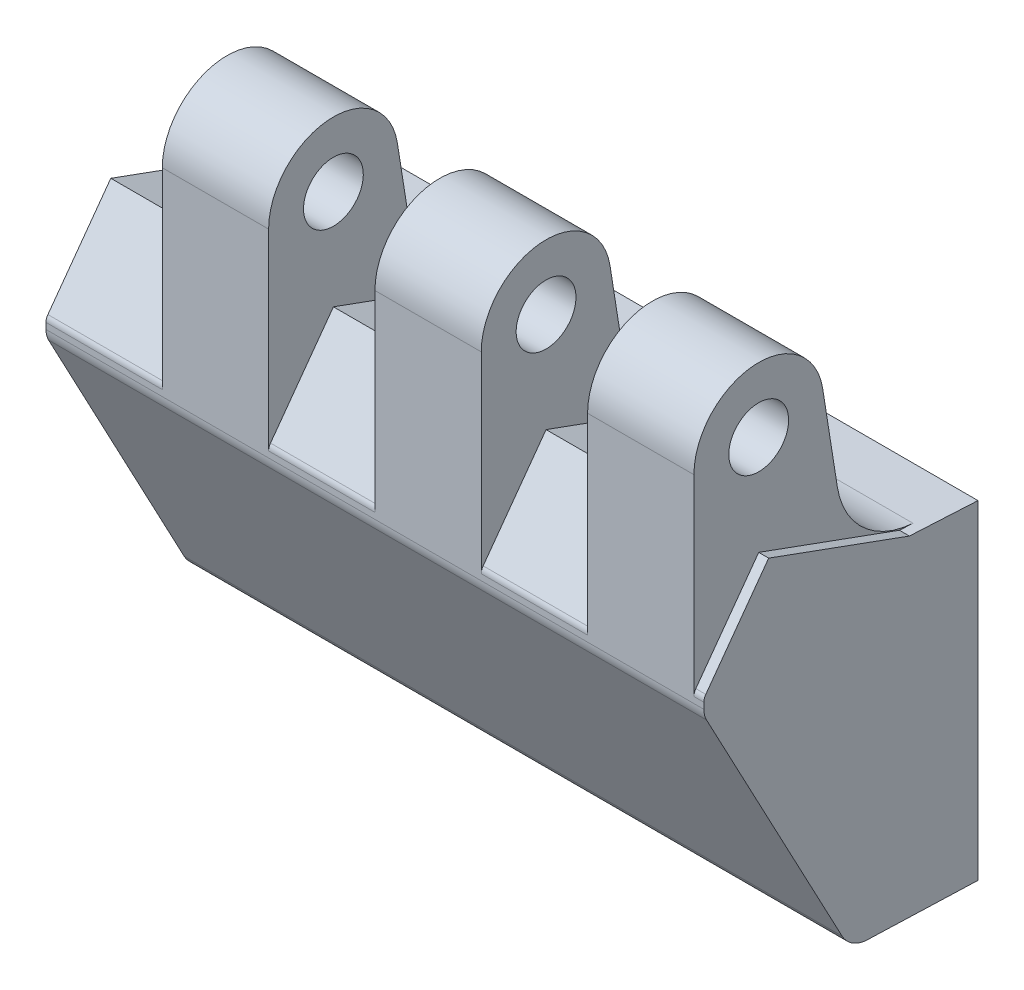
ISO-10303-21;
HEADER;
FILE_DESCRIPTION(('STEP AP214'),'2;1');
FILE_NAME('part.step','',(''),(''),'','','');
FILE_SCHEMA(('AUTOMOTIVE_DESIGN { 1 0 10303 214 1 1 1 1 }'));
ENDSEC;
DATA;
#1=APPLICATION_CONTEXT('core data for automotive mechanical design processes');
#2=APPLICATION_PROTOCOL_DEFINITION('international standard','automotive_design',2000,#1);
#3=PRODUCT_CONTEXT('',#1,'mechanical');
#4=PRODUCT('Part','Part','',(#3));
#5=PRODUCT_RELATED_PRODUCT_CATEGORY('part','',(#4));
#6=PRODUCT_DEFINITION_FORMATION('','',#4);
#7=PRODUCT_DEFINITION_CONTEXT('part definition',#1,'design');
#8=PRODUCT_DEFINITION('design','',#6,#7);
#9=PRODUCT_DEFINITION_SHAPE('','',#8);
#10=(LENGTH_UNIT() NAMED_UNIT(*) SI_UNIT(.MILLI.,.METRE.));
#11=(NAMED_UNIT(*) PLANE_ANGLE_UNIT() SI_UNIT($,.RADIAN.));
#12=(NAMED_UNIT(*) SI_UNIT($,.STERADIAN.) SOLID_ANGLE_UNIT());
#13=UNCERTAINTY_MEASURE_WITH_UNIT(LENGTH_MEASURE(1.E-05),#10,'distance_accuracy_value','');
#14=(GEOMETRIC_REPRESENTATION_CONTEXT(3) GLOBAL_UNCERTAINTY_ASSIGNED_CONTEXT((#13)) GLOBAL_UNIT_ASSIGNED_CONTEXT((#10,
#11,#12)) REPRESENTATION_CONTEXT('',''));
#15=CARTESIAN_POINT('',(0.,0.,0.));
#16=DIRECTION('',(0.,0.,1.));
#17=DIRECTION('',(1.,0.,0.));
#18=AXIS2_PLACEMENT_3D('',#15,#16,#17);
#19=CARTESIAN_POINT('',(-16.5,16.35,0.));
#20=DIRECTION('',(0.,0.998629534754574,-0.0523359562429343));
#21=DIRECTION('',(0.,0.0523359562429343,0.998629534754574));
#22=AXIS2_PLACEMENT_3D('',#19,#20,#21);
#23=PLANE('',#22);
#24=DIRECTION('',(-1.,0.,0.));
#25=VECTOR('',#24,1.);
#26=CARTESIAN_POINT('',(48.5,16.6393206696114,5.520567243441));
#27=LINE('',#26,#25);
#28=CARTESIAN_POINT('',(37.833333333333,16.6393206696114,5.52056724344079));
#29=VERTEX_POINT('',#28);
#30=CARTESIAN_POINT('',(48.5,16.6393206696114,5.520567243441));
#31=VERTEX_POINT('',#30);
#32=EDGE_CURVE('E9',#29,#31,#27,.F.);
#33=ORIENTED_EDGE('',*,*,#32,.T.);
#34=DIRECTION('',(0.,0.0523359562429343,0.998629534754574));
#35=VECTOR('',#34,1.);
#36=CARTESIAN_POINT('',(48.5,16.35,0.));
#37=LINE('',#36,#35);
#38=CARTESIAN_POINT('',(48.5,16.71068751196,6.8823277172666));
#39=VERTEX_POINT('',#38);
#40=EDGE_CURVE('E303',#31,#39,#37,.T.);
#41=ORIENTED_EDGE('',*,*,#40,.T.);
#42=DIRECTION('',(1.,0.,0.));
#43=VECTOR('',#42,1.);
#44=CARTESIAN_POINT('',(-16.5,16.71068751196,6.8823277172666));
#45=LINE('',#44,#43);
#46=CARTESIAN_POINT('',(49.5,16.71068751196,6.8823277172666));
#47=VERTEX_POINT('',#46);
#48=EDGE_CURVE('E506',#39,#47,#45,.T.);
#49=ORIENTED_EDGE('',*,*,#48,.T.);
#50=DIRECTION('',(0.,0.0523359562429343,0.998629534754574));
#51=VECTOR('',#50,1.);
#52=CARTESIAN_POINT('',(49.5,16.35,0.));
#53=LINE('',#52,#51);
#54=CARTESIAN_POINT('',(49.5,16.35,0.));
#55=VERTEX_POINT('',#54);
#56=EDGE_CURVE('E426',#55,#47,#53,.T.);
#57=ORIENTED_EDGE('',*,*,#56,.F.);
#58=DIRECTION('',(1.,0.,0.));
#59=VECTOR('',#58,1.);
#60=CARTESIAN_POINT('',(-16.5,16.35,0.));
#61=LINE('',#60,#59);
#62=CARTESIAN_POINT('',(-16.5,16.35,0.));
#63=VERTEX_POINT('',#62);
#64=EDGE_CURVE('E512',#63,#55,#61,.T.);
#65=ORIENTED_EDGE('',*,*,#64,.F.);
#66=DIRECTION('',(0.,0.0523359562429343,0.998629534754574));
#67=VECTOR('',#66,1.);
#68=CARTESIAN_POINT('',(-16.5,16.35,0.));
#69=LINE('',#68,#67);
#70=CARTESIAN_POINT('',(-16.5,16.71068751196,6.8823277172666));
#71=VERTEX_POINT('',#70);
#72=EDGE_CURVE('E456',#63,#71,#69,.T.);
#73=ORIENTED_EDGE('',*,*,#72,.T.);
#74=CARTESIAN_POINT('',(-4.833333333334,16.71068751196,6.8823277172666));
#75=VERTEX_POINT('',#74);
#76=EDGE_CURVE('E509',#71,#75,#45,.T.);
#77=ORIENTED_EDGE('',*,*,#76,.T.);
#78=DIRECTION('',(0.,0.0523359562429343,0.998629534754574));
#79=VECTOR('',#78,1.);
#80=CARTESIAN_POINT('',(-4.833333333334,16.35,0.));
#81=LINE('',#80,#79);
#82=CARTESIAN_POINT('',(-4.833333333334,16.6393206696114,5.52056724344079));
#83=VERTEX_POINT('',#82);
#84=EDGE_CURVE('E362',#83,#75,#81,.T.);
#85=ORIENTED_EDGE('',*,*,#84,.F.);
#86=DIRECTION('',(1.,0.,0.));
#87=VECTOR('',#86,1.);
#88=CARTESIAN_POINT('',(-4.833333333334,16.6393206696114,5.520567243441));
#89=LINE('',#88,#87);
#90=CARTESIAN_POINT('',(5.833333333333,16.6393206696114,5.52056724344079));
#91=VERTEX_POINT('',#90);
#92=EDGE_CURVE('E22',#91,#83,#89,.F.);
#93=ORIENTED_EDGE('',*,*,#92,.F.);
#94=DIRECTION('',(0.,0.0523359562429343,0.998629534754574));
#95=VECTOR('',#94,1.);
#96=CARTESIAN_POINT('',(5.833333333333,16.35,0.));
#97=LINE('',#96,#95);
#98=CARTESIAN_POINT('',(5.833333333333,16.71068751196,6.8823277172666));
#99=VERTEX_POINT('',#98);
#100=EDGE_CURVE('E353',#91,#99,#97,.T.);
#101=ORIENTED_EDGE('',*,*,#100,.T.);
#102=CARTESIAN_POINT('',(16.5,16.71068751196,6.8823277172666));
#103=VERTEX_POINT('',#102);
#104=EDGE_CURVE('E513',#99,#103,#45,.T.);
#105=ORIENTED_EDGE('',*,*,#104,.T.);
#106=DIRECTION('',(0.,0.0523359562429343,0.998629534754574));
#107=VECTOR('',#106,1.);
#108=CARTESIAN_POINT('',(16.5,16.35,0.));
#109=LINE('',#108,#107);
#110=CARTESIAN_POINT('',(16.5,16.6393206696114,5.52056724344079));
#111=VERTEX_POINT('',#110);
#112=EDGE_CURVE('E411',#111,#103,#109,.T.);
#113=ORIENTED_EDGE('',*,*,#112,.F.);
#114=DIRECTION('',(-1.,0.,0.));
#115=VECTOR('',#114,1.);
#116=CARTESIAN_POINT('',(27.166666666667,16.6393206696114,5.520567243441));
#117=LINE('',#116,#115);
#118=CARTESIAN_POINT('',(27.166666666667,16.6393206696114,5.520567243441));
#119=VERTEX_POINT('',#118);
#120=EDGE_CURVE('E518',#111,#119,#117,.F.);
#121=ORIENTED_EDGE('',*,*,#120,.T.);
#122=DIRECTION('',(0.,0.0523359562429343,0.998629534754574));
#123=VECTOR('',#122,1.);
#124=CARTESIAN_POINT('',(27.166666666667,16.35,0.));
#125=LINE('',#124,#123);
#126=CARTESIAN_POINT('',(27.166666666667,16.71068751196,6.8823277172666));
#127=VERTEX_POINT('',#126);
#128=EDGE_CURVE('E420',#119,#127,#125,.T.);
#129=ORIENTED_EDGE('',*,*,#128,.T.);
#130=CARTESIAN_POINT('',(37.833333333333,16.71068751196,6.8823277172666));
#131=VERTEX_POINT('',#130);
#132=EDGE_CURVE('E514',#127,#131,#45,.T.);
#133=ORIENTED_EDGE('',*,*,#132,.T.);
#134=DIRECTION('',(0.,0.0523359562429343,0.998629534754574));
#135=VECTOR('',#134,1.);
#136=CARTESIAN_POINT('',(37.833333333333,16.35,0.));
#137=LINE('',#136,#135);
#138=EDGE_CURVE('E32',#29,#131,#137,.T.);
#139=ORIENTED_EDGE('',*,*,#138,.F.);
#140=EDGE_LOOP('',(#33,#41,#49,#57,#65,#73,#77,#85,#93,#101,#105,#113,#121,#129,#133,#139));
#141=FACE_BOUND('',#140,.T.);
#142=ADVANCED_FACE('F14',(#141),#23,.T.);
#143=CARTESIAN_POINT('',(-16.5,16.71068751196,6.8823277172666));
#144=DIRECTION('',(0.,0.939692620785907,-0.342020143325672));
#145=DIRECTION('',(0.,0.342020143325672,0.939692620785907));
#146=AXIS2_PLACEMENT_3D('',#143,#144,#145);
#147=PLANE('',#146);
#148=ORIENTED_EDGE('',*,*,#48,.F.);
#149=DIRECTION('',(0.,0.342020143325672,0.939692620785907));
#150=VECTOR('',#149,1.);
#151=CARTESIAN_POINT('',(48.5,16.71068751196,6.8823277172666));
#152=LINE('',#151,#150);
#153=CARTESIAN_POINT('',(48.5,21.8491,21.));
#154=VERTEX_POINT('',#153);
#155=EDGE_CURVE('E301',#39,#154,#152,.T.);
#156=ORIENTED_EDGE('',*,*,#155,.T.);
#157=DIRECTION('',(1.,0.,0.));
#158=VECTOR('',#157,1.);
#159=CARTESIAN_POINT('',(-16.5,21.8491,21.));
#160=LINE('',#159,#158);
#161=CARTESIAN_POINT('',(49.5,21.8491,21.));
#162=VERTEX_POINT('',#161);
#163=EDGE_CURVE('E500',#154,#162,#160,.T.);
#164=ORIENTED_EDGE('',*,*,#163,.T.);
#165=DIRECTION('',(0.,0.342020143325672,0.939692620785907));
#166=VECTOR('',#165,1.);
#167=CARTESIAN_POINT('',(49.5,16.71068751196,6.8823277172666));
#168=LINE('',#167,#166);
#169=EDGE_CURVE('E429',#47,#162,#168,.T.);
#170=ORIENTED_EDGE('',*,*,#169,.F.);
#171=EDGE_LOOP('',(#148,#156,#164,#170));
#172=FACE_BOUND('',#171,.T.);
#173=ADVANCED_FACE('F574',(#172),#147,.T.);
#174=CARTESIAN_POINT('',(-16.5,21.8491,21.));
#175=DIRECTION('',(0.,0.587785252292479,0.809016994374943));
#176=DIRECTION('',(0.,-0.809016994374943,0.587785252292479));
#177=AXIS2_PLACEMENT_3D('',#174,#175,#176);
#178=PLANE('',#177);
#179=ORIENTED_EDGE('',*,*,#163,.F.);
#180=DIRECTION('',(0.,-0.809016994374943,0.587785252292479));
#181=VECTOR('',#180,1.);
#182=CARTESIAN_POINT('',(48.5,21.8491,21.));
#183=LINE('',#182,#181);
#184=CARTESIAN_POINT('',(48.5,13.165483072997,27.309016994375));
#185=VERTEX_POINT('',#184);
#186=EDGE_CURVE('E299',#154,#185,#183,.T.);
#187=ORIENTED_EDGE('',*,*,#186,.T.);
#188=DIRECTION('',(1.,0.,0.));
#189=VECTOR('',#188,1.);
#190=CARTESIAN_POINT('',(-16.5,13.165483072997,27.309016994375));
#191=LINE('',#190,#189);
#192=CARTESIAN_POINT('',(49.5,13.165483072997,27.309016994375));
#193=VERTEX_POINT('',#192);
#194=EDGE_CURVE('E494',#185,#193,#191,.T.);
#195=ORIENTED_EDGE('',*,*,#194,.T.);
#196=DIRECTION('',(0.,-0.809016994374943,0.587785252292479));
#197=VECTOR('',#196,1.);
#198=CARTESIAN_POINT('',(49.5,21.8491,21.));
#199=LINE('',#198,#197);
#200=EDGE_CURVE('E432',#162,#193,#199,.T.);
#201=ORIENTED_EDGE('',*,*,#200,.F.);
#202=EDGE_LOOP('',(#179,#187,#195,#201));
#203=FACE_BOUND('',#202,.T.);
#204=ADVANCED_FACE('F613',(#203),#178,.T.);
#205=CARTESIAN_POINT('',(-16.5,12.5776978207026,26.4999999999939));
#206=DIRECTION('',(1.,0.,0.));
#207=DIRECTION('',(0.,1.,0.));
#208=AXIS2_PLACEMENT_3D('',#205,#206,#207);
#209=CYLINDRICAL_SURFACE('',#208,1.0000000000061);
#210=ORIENTED_EDGE('',*,*,#194,.F.);
#211=CARTESIAN_POINT('',(48.5,12.5776978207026,26.4999999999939));
#212=DIRECTION('',(-1.,0.,0.));
#213=DIRECTION('',(0.,-1.,0.));
#214=AXIS2_PLACEMENT_3D('',#211,#212,#213);
#215=CIRCLE('',#214,1.0000000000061);
#216=CARTESIAN_POINT('',(48.5,12.577697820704,27.5));
#217=VERTEX_POINT('',#216);
#218=EDGE_CURVE('E297',#185,#217,#215,.F.);
#219=ORIENTED_EDGE('',*,*,#218,.T.);
#220=DIRECTION('',(1.,0.,0.));
#221=VECTOR('',#220,1.);
#222=CARTESIAN_POINT('',(-16.5,12.577697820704,27.5));
#223=LINE('',#222,#221);
#224=CARTESIAN_POINT('',(49.5,12.577697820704,27.5));
#225=VERTEX_POINT('',#224);
#226=EDGE_CURVE('E490',#217,#225,#223,.T.);
#227=ORIENTED_EDGE('',*,*,#226,.T.);
#228=CARTESIAN_POINT('',(49.5,12.5776978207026,26.4999999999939));
#229=DIRECTION('',(1.,0.,0.));
#230=DIRECTION('',(0.,1.,0.));
#231=AXIS2_PLACEMENT_3D('',#228,#229,#230);
#232=CIRCLE('',#231,1.0000000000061);
#233=EDGE_CURVE('E435',#193,#225,#232,.T.);
#234=ORIENTED_EDGE('',*,*,#233,.F.);
#235=EDGE_LOOP('',(#210,#219,#227,#234));
#236=FACE_BOUND('',#235,.T.);
#237=ADVANCED_FACE('F618',(#236),#209,.T.);
#238=ORIENTED_EDGE('',*,*,#104,.F.);
#239=DIRECTION('',(0.,0.342020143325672,0.939692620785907));
#240=VECTOR('',#239,1.);
#241=CARTESIAN_POINT('',(5.833333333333,16.71068751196,6.8823277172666));
#242=LINE('',#241,#240);
#243=CARTESIAN_POINT('',(5.833333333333,21.8491,21.));
#244=VERTEX_POINT('',#243);
#245=EDGE_CURVE('E350',#99,#244,#242,.T.);
#246=ORIENTED_EDGE('',*,*,#245,.T.);
#247=CARTESIAN_POINT('',(16.5,21.8491,21.));
#248=VERTEX_POINT('',#247);
#249=EDGE_CURVE('E507',#244,#248,#160,.T.);
#250=ORIENTED_EDGE('',*,*,#249,.T.);
#251=DIRECTION('',(0.,0.342020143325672,0.939692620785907));
#252=VECTOR('',#251,1.);
#253=CARTESIAN_POINT('',(16.5,16.71068751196,6.8823277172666));
#254=LINE('',#253,#252);
#255=EDGE_CURVE('E408',#103,#248,#254,.T.);
#256=ORIENTED_EDGE('',*,*,#255,.F.);
#257=EDGE_LOOP('',(#238,#246,#250,#256));
#258=FACE_BOUND('',#257,.T.);
#259=ADVANCED_FACE('F563',(#258),#147,.T.);
#260=ORIENTED_EDGE('',*,*,#249,.F.);
#261=DIRECTION('',(0.,-0.809016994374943,0.587785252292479));
#262=VECTOR('',#261,1.);
#263=CARTESIAN_POINT('',(5.833333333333,21.8491,21.));
#264=LINE('',#263,#262);
#265=CARTESIAN_POINT('',(5.833333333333,13.165483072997,27.309016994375));
#266=VERTEX_POINT('',#265);
#267=EDGE_CURVE('E347',#244,#266,#264,.T.);
#268=ORIENTED_EDGE('',*,*,#267,.T.);
#269=CARTESIAN_POINT('',(16.5,13.165483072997,27.309016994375));
#270=VERTEX_POINT('',#269);
#271=EDGE_CURVE('E501',#266,#270,#191,.T.);
#272=ORIENTED_EDGE('',*,*,#271,.T.);
#273=DIRECTION('',(0.,-0.809016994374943,0.587785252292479));
#274=VECTOR('',#273,1.);
#275=CARTESIAN_POINT('',(16.5,21.8491,21.));
#276=LINE('',#275,#274);
#277=EDGE_CURVE('E405',#248,#270,#276,.T.);
#278=ORIENTED_EDGE('',*,*,#277,.F.);
#279=EDGE_LOOP('',(#260,#268,#272,#278));
#280=FACE_BOUND('',#279,.T.);
#281=ADVANCED_FACE('F581',(#280),#178,.T.);
#282=ORIENTED_EDGE('',*,*,#271,.F.);
#283=CARTESIAN_POINT('',(5.833333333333,12.5776978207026,26.4999999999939));
#284=DIRECTION('',(-1.,0.,0.));
#285=DIRECTION('',(0.,-1.,0.));
#286=AXIS2_PLACEMENT_3D('',#283,#284,#285);
#287=CIRCLE('',#286,1.0000000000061);
#288=CARTESIAN_POINT('',(5.833333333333,12.577697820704,27.5));
#289=VERTEX_POINT('',#288);
#290=EDGE_CURVE('E344',#266,#289,#287,.F.);
#291=ORIENTED_EDGE('',*,*,#290,.T.);
#292=CARTESIAN_POINT('',(16.5,12.577697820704,27.5));
#293=VERTEX_POINT('',#292);
#294=EDGE_CURVE('E495',#289,#293,#223,.T.);
#295=ORIENTED_EDGE('',*,*,#294,.T.);
#296=CARTESIAN_POINT('',(16.5,12.5776978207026,26.4999999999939));
#297=DIRECTION('',(-1.,0.,0.));
#298=DIRECTION('',(0.,-1.,0.));
#299=AXIS2_PLACEMENT_3D('',#296,#297,#298);
#300=CIRCLE('',#299,1.0000000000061);
#301=EDGE_CURVE('E402',#270,#293,#300,.F.);
#302=ORIENTED_EDGE('',*,*,#301,.F.);
#303=EDGE_LOOP('',(#282,#291,#295,#302));
#304=FACE_BOUND('',#303,.T.);
#305=ADVANCED_FACE('F621',(#304),#209,.T.);
#306=DIRECTION('',(0.,0.342020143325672,0.939692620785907));
#307=VECTOR('',#306,1.);
#308=CARTESIAN_POINT('',(37.833333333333,16.71068751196,6.8823277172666));
#309=LINE('',#308,#307);
#310=CARTESIAN_POINT('',(37.833333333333,21.8491,21.));
#311=VERTEX_POINT('',#310);
#312=EDGE_CURVE('E293',#131,#311,#309,.T.);
#313=ORIENTED_EDGE('',*,*,#312,.F.);
#314=ORIENTED_EDGE('',*,*,#132,.F.);
#315=DIRECTION('',(0.,0.342020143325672,0.939692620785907));
#316=VECTOR('',#315,1.);
#317=CARTESIAN_POINT('',(27.166666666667,16.71068751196,6.8823277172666));
#318=LINE('',#317,#316);
#319=CARTESIAN_POINT('',(27.166666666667,21.8491,21.));
#320=VERTEX_POINT('',#319);
#321=EDGE_CURVE('E418',#127,#320,#318,.T.);
#322=ORIENTED_EDGE('',*,*,#321,.T.);
#323=EDGE_CURVE('E508',#320,#311,#160,.T.);
#324=ORIENTED_EDGE('',*,*,#323,.T.);
#325=EDGE_LOOP('',(#313,#314,#322,#324));
#326=FACE_BOUND('',#325,.T.);
#327=ADVANCED_FACE('F604',(#326),#147,.T.);
#328=DIRECTION('',(0.,-0.809016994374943,0.587785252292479));
#329=VECTOR('',#328,1.);
#330=CARTESIAN_POINT('',(37.833333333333,21.8491,21.));
#331=LINE('',#330,#329);
#332=CARTESIAN_POINT('',(37.833333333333,13.165483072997,27.309016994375));
#333=VERTEX_POINT('',#332);
#334=EDGE_CURVE('E290',#311,#333,#331,.T.);
#335=ORIENTED_EDGE('',*,*,#334,.F.);
#336=ORIENTED_EDGE('',*,*,#323,.F.);
#337=DIRECTION('',(0.,-0.809016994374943,0.587785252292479));
#338=VECTOR('',#337,1.);
#339=CARTESIAN_POINT('',(27.166666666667,21.8491,21.));
#340=LINE('',#339,#338);
#341=CARTESIAN_POINT('',(27.166666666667,13.165483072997,27.309016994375));
#342=VERTEX_POINT('',#341);
#343=EDGE_CURVE('E416',#320,#342,#340,.T.);
#344=ORIENTED_EDGE('',*,*,#343,.T.);
#345=EDGE_CURVE('E502',#342,#333,#191,.T.);
#346=ORIENTED_EDGE('',*,*,#345,.T.);
#347=EDGE_LOOP('',(#335,#336,#344,#346));
#348=FACE_BOUND('',#347,.T.);
#349=ADVANCED_FACE('F608',(#348),#178,.T.);
#350=CARTESIAN_POINT('',(37.833333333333,12.5776978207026,26.4999999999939));
#351=DIRECTION('',(-1.,0.,0.));
#352=DIRECTION('',(0.,-1.,0.));
#353=AXIS2_PLACEMENT_3D('',#350,#351,#352);
#354=CIRCLE('',#353,1.0000000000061);
#355=CARTESIAN_POINT('',(37.833333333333,12.577697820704,27.5));
#356=VERTEX_POINT('',#355);
#357=EDGE_CURVE('E249',#333,#356,#354,.F.);
#358=ORIENTED_EDGE('',*,*,#357,.F.);
#359=ORIENTED_EDGE('',*,*,#345,.F.);
#360=CARTESIAN_POINT('',(27.166666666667,12.5776978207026,26.4999999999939));
#361=DIRECTION('',(-1.,0.,0.));
#362=DIRECTION('',(0.,-1.,0.));
#363=AXIS2_PLACEMENT_3D('',#360,#361,#362);
#364=CIRCLE('',#363,1.0000000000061);
#365=CARTESIAN_POINT('',(27.166666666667,12.577697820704,27.5));
#366=VERTEX_POINT('',#365);
#367=EDGE_CURVE('E414',#342,#366,#364,.F.);
#368=ORIENTED_EDGE('',*,*,#367,.T.);
#369=EDGE_CURVE('E496',#366,#356,#223,.T.);
#370=ORIENTED_EDGE('',*,*,#369,.T.);
#371=EDGE_LOOP('',(#358,#359,#368,#370));
#372=FACE_BOUND('',#371,.T.);
#373=ADVANCED_FACE('F659',(#372),#209,.T.);
#374=CARTESIAN_POINT('',(-16.5,-16.262685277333,11.091242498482));
#375=DIRECTION('',(0.,-0.999390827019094,0.0348994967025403));
#376=DIRECTION('',(0.,-0.0348994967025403,-0.999390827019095));
#377=AXIS2_PLACEMENT_3D('',#374,#375,#376);
#378=PLANE('',#377);
#379=DIRECTION('',(1.,0.,0.));
#380=VECTOR('',#379,1.);
#381=CARTESIAN_POINT('',(-16.5,-16.65,0.));
#382=LINE('',#381,#380);
#383=CARTESIAN_POINT('',(-16.5,-16.65,0.));
#384=VERTEX_POINT('',#383);
#385=CARTESIAN_POINT('',(49.5,-16.65,0.));
#386=VERTEX_POINT('',#385);
#387=EDGE_CURVE('E516',#384,#386,#382,.T.);
#388=ORIENTED_EDGE('',*,*,#387,.T.);
#389=DIRECTION('',(0.,-0.0348994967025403,-0.999390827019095));
#390=VECTOR('',#389,1.);
#391=CARTESIAN_POINT('',(49.5,-16.262685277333,11.091242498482));
#392=LINE('',#391,#390);
#393=CARTESIAN_POINT('',(49.5,-16.262685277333,11.091242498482));
#394=VERTEX_POINT('',#393);
#395=EDGE_CURVE('E422',#394,#386,#392,.T.);
#396=ORIENTED_EDGE('',*,*,#395,.F.);
#397=DIRECTION('',(1.,0.,0.));
#398=VECTOR('',#397,1.);
#399=CARTESIAN_POINT('',(-16.5,-16.262685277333,11.091242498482));
#400=LINE('',#399,#398);
#401=CARTESIAN_POINT('',(-16.5,-16.262685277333,11.091242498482));
#402=VERTEX_POINT('',#401);
#403=EDGE_CURVE('E480',#402,#394,#400,.T.);
#404=ORIENTED_EDGE('',*,*,#403,.F.);
#405=DIRECTION('',(0.,-0.0348994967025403,-0.999390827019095));
#406=VECTOR('',#405,1.);
#407=CARTESIAN_POINT('',(-16.5,-16.262685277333,11.091242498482));
#408=LINE('',#407,#406);
#409=EDGE_CURVE('E450',#402,#384,#408,.T.);
#410=ORIENTED_EDGE('',*,*,#409,.T.);
#411=EDGE_LOOP('',(#388,#396,#404,#410));
#412=FACE_BOUND('',#411,.T.);
#413=ADVANCED_FACE('F16',(#412),#378,.T.);
#414=CARTESIAN_POINT('',(-16.5,-16.65,0.));
#415=DIRECTION('',(0.,0.,-1.));
#416=DIRECTION('',(-1.,0.,0.));
#417=AXIS2_PLACEMENT_3D('',#414,#415,#416);
#418=PLANE('',#417);
#419=CARTESIAN_POINT('',(0.,0.,0.));
#420=DIRECTION('',(0.,0.,-1.));
#421=DIRECTION('',(-1.,0.,0.));
#422=AXIS2_PLACEMENT_3D('',#419,#420,#421);
#423=CIRCLE('',#422,3.);
#424=CARTESIAN_POINT('',(-3.,0.,0.));
#425=VERTEX_POINT('',#424);
#426=EDGE_CURVE('E664',#425,#425,#423,.T.);
#427=ORIENTED_EDGE('',*,*,#426,.F.);
#428=EDGE_LOOP('',(#427));
#429=FACE_BOUND('',#428,.T.);
#430=CARTESIAN_POINT('',(33.,0.,0.));
#431=DIRECTION('',(0.,0.,-1.));
#432=DIRECTION('',(-1.,0.,0.));
#433=AXIS2_PLACEMENT_3D('',#430,#431,#432);
#434=CIRCLE('',#433,3.);
#435=CARTESIAN_POINT('',(30.,0.,0.));
#436=VERTEX_POINT('',#435);
#437=EDGE_CURVE('E668',#436,#436,#434,.T.);
#438=ORIENTED_EDGE('',*,*,#437,.F.);
#439=EDGE_LOOP('',(#438));
#440=FACE_BOUND('',#439,.T.);
#441=ORIENTED_EDGE('',*,*,#64,.T.);
#442=DIRECTION('',(0.,1.,0.));
#443=VECTOR('',#442,1.);
#444=CARTESIAN_POINT('',(49.5,-16.65,0.));
#445=LINE('',#444,#443);
#446=EDGE_CURVE('E423',#386,#55,#445,.T.);
#447=ORIENTED_EDGE('',*,*,#446,.F.);
#448=ORIENTED_EDGE('',*,*,#387,.F.);
#449=DIRECTION('',(0.,1.,0.));
#450=VECTOR('',#449,1.);
#451=CARTESIAN_POINT('',(-16.5,-16.65,0.));
#452=LINE('',#451,#450);
#453=EDGE_CURVE('E453',#384,#63,#452,.T.);
#454=ORIENTED_EDGE('',*,*,#453,.T.);
#455=EDGE_LOOP('',(#441,#447,#448,#454));
#456=FACE_BOUND('',#455,.T.);
#457=ADVANCED_FACE('F651',(#429,#440,#456),#418,.T.);
#458=DIRECTION('',(0.,0.342020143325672,0.939692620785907));
#459=VECTOR('',#458,1.);
#460=CARTESIAN_POINT('',(-4.833333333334,16.71068751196,6.8823277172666));
#461=LINE('',#460,#459);
#462=CARTESIAN_POINT('',(-4.833333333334,21.8491,21.));
#463=VERTEX_POINT('',#462);
#464=EDGE_CURVE('E360',#75,#463,#461,.T.);
#465=ORIENTED_EDGE('',*,*,#464,.F.);
#466=ORIENTED_EDGE('',*,*,#76,.F.);
#467=DIRECTION('',(0.,0.342020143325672,0.939692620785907));
#468=VECTOR('',#467,1.);
#469=CARTESIAN_POINT('',(-16.5,16.71068751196,6.8823277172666));
#470=LINE('',#469,#468);
#471=CARTESIAN_POINT('',(-16.5,21.8491,21.));
#472=VERTEX_POINT('',#471);
#473=EDGE_CURVE('E459',#71,#472,#470,.T.);
#474=ORIENTED_EDGE('',*,*,#473,.T.);
#475=EDGE_CURVE('E503',#472,#463,#160,.T.);
#476=ORIENTED_EDGE('',*,*,#475,.T.);
#477=EDGE_LOOP('',(#465,#466,#474,#476));
#478=FACE_BOUND('',#477,.T.);
#479=ADVANCED_FACE('F535',(#478),#147,.T.);
#480=DIRECTION('',(0.,-0.809016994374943,0.587785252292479));
#481=VECTOR('',#480,1.);
#482=CARTESIAN_POINT('',(-4.833333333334,21.8491,21.));
#483=LINE('',#482,#481);
#484=CARTESIAN_POINT('',(-4.833333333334,13.165483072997,27.309016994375));
#485=VERTEX_POINT('',#484);
#486=EDGE_CURVE('E358',#463,#485,#483,.T.);
#487=ORIENTED_EDGE('',*,*,#486,.F.);
#488=ORIENTED_EDGE('',*,*,#475,.F.);
#489=DIRECTION('',(0.,-0.809016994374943,0.587785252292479));
#490=VECTOR('',#489,1.);
#491=CARTESIAN_POINT('',(-16.5,21.8491,21.));
#492=LINE('',#491,#490);
#493=CARTESIAN_POINT('',(-16.5,13.165483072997,27.309016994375));
#494=VERTEX_POINT('',#493);
#495=EDGE_CURVE('E462',#472,#494,#492,.T.);
#496=ORIENTED_EDGE('',*,*,#495,.T.);
#497=EDGE_CURVE('E497',#494,#485,#191,.T.);
#498=ORIENTED_EDGE('',*,*,#497,.T.);
#499=EDGE_LOOP('',(#487,#488,#496,#498));
#500=FACE_BOUND('',#499,.T.);
#501=ADVANCED_FACE('F540',(#500),#178,.T.);
#502=CARTESIAN_POINT('',(-4.833333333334,12.5776978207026,26.4999999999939));
#503=DIRECTION('',(-1.,0.,0.));
#504=DIRECTION('',(0.,-1.,0.));
#505=AXIS2_PLACEMENT_3D('',#502,#503,#504);
#506=CIRCLE('',#505,1.0000000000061);
#507=CARTESIAN_POINT('',(-4.833333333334,12.577697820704,27.5));
#508=VERTEX_POINT('',#507);
#509=EDGE_CURVE('E356',#485,#508,#506,.F.);
#510=ORIENTED_EDGE('',*,*,#509,.F.);
#511=ORIENTED_EDGE('',*,*,#497,.F.);
#512=CARTESIAN_POINT('',(-16.5,12.5776978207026,26.4999999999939));
#513=DIRECTION('',(1.,0.,0.));
#514=DIRECTION('',(0.,1.,0.));
#515=AXIS2_PLACEMENT_3D('',#512,#513,#514);
#516=CIRCLE('',#515,1.0000000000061);
#517=CARTESIAN_POINT('',(-16.5,12.577697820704,27.5));
#518=VERTEX_POINT('',#517);
#519=EDGE_CURVE('E465',#494,#518,#516,.T.);
#520=ORIENTED_EDGE('',*,*,#519,.T.);
#521=EDGE_CURVE('E491',#518,#508,#223,.T.);
#522=ORIENTED_EDGE('',*,*,#521,.T.);
#523=EDGE_LOOP('',(#510,#511,#520,#522));
#524=FACE_BOUND('',#523,.T.);
#525=ADVANCED_FACE('F543',(#524),#209,.T.);
#526=CARTESIAN_POINT('',(-16.5,12.577697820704,27.5));
#527=DIRECTION('',(0.,0.,1.));
#528=DIRECTION('',(1.,0.,0.));
#529=AXIS2_PLACEMENT_3D('',#526,#527,#528);
#530=PLANE('',#529);
#531=ORIENTED_EDGE('',*,*,#226,.F.);
#532=DIRECTION('',(0.,-1.,0.));
#533=VECTOR('',#532,1.);
#534=CARTESIAN_POINT('',(48.5,31.85,27.5));
#535=LINE('',#534,#533);
#536=CARTESIAN_POINT('',(48.5,31.85,27.5));
#537=VERTEX_POINT('',#536);
#538=EDGE_CURVE('E273',#537,#217,#535,.T.);
#539=ORIENTED_EDGE('',*,*,#538,.F.);
#540=DIRECTION('',(-1.,0.,0.));
#541=VECTOR('',#540,1.);
#542=CARTESIAN_POINT('',(48.5,31.85,27.5));
#543=LINE('',#542,#541);
#544=CARTESIAN_POINT('',(37.833333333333,31.85,27.5));
#545=VERTEX_POINT('',#544);
#546=EDGE_CURVE('E284',#537,#545,#543,.T.);
#547=ORIENTED_EDGE('',*,*,#546,.T.);
#548=DIRECTION('',(0.,-1.,0.));
#549=VECTOR('',#548,1.);
#550=CARTESIAN_POINT('',(37.833333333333,31.85,27.5));
#551=LINE('',#550,#549);
#552=EDGE_CURVE('E242',#545,#356,#551,.T.);
#553=ORIENTED_EDGE('',*,*,#552,.T.);
#554=ORIENTED_EDGE('',*,*,#369,.F.);
#555=DIRECTION('',(0.,-1.,0.));
#556=VECTOR('',#555,1.);
#557=CARTESIAN_POINT('',(27.166666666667,31.85,27.5));
#558=LINE('',#557,#556);
#559=CARTESIAN_POINT('',(27.166666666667,31.85,27.5));
#560=VERTEX_POINT('',#559);
#561=EDGE_CURVE('E381',#560,#366,#558,.T.);
#562=ORIENTED_EDGE('',*,*,#561,.F.);
#563=DIRECTION('',(-1.,0.,0.));
#564=VECTOR('',#563,1.);
#565=CARTESIAN_POINT('',(27.166666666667,31.85,27.5));
#566=LINE('',#565,#564);
#567=CARTESIAN_POINT('',(16.5,31.85,27.5));
#568=VERTEX_POINT('',#567);
#569=EDGE_CURVE('E393',#560,#568,#566,.T.);
#570=ORIENTED_EDGE('',*,*,#569,.T.);
#571=DIRECTION('',(0.,-1.,0.));
#572=VECTOR('',#571,1.);
#573=CARTESIAN_POINT('',(16.5,31.85,27.5));
#574=LINE('',#573,#572);
#575=EDGE_CURVE('E364',#568,#293,#574,.T.);
#576=ORIENTED_EDGE('',*,*,#575,.T.);
#577=ORIENTED_EDGE('',*,*,#294,.F.);
#578=DIRECTION('',(0.,-1.,0.));
#579=VECTOR('',#578,1.);
#580=CARTESIAN_POINT('',(5.833333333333,31.85,27.5));
#581=LINE('',#580,#579);
#582=CARTESIAN_POINT('',(5.833333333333,31.85,27.5));
#583=VERTEX_POINT('',#582);
#584=EDGE_CURVE('E305',#583,#289,#581,.T.);
#585=ORIENTED_EDGE('',*,*,#584,.F.);
#586=DIRECTION('',(1.,0.,0.));
#587=VECTOR('',#586,1.);
#588=CARTESIAN_POINT('',(-4.833333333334,31.85,27.5));
#589=LINE('',#588,#587);
#590=CARTESIAN_POINT('',(-4.833333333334,31.85,27.5));
#591=VERTEX_POINT('',#590);
#592=EDGE_CURVE('E337',#591,#583,#589,.T.);
#593=ORIENTED_EDGE('',*,*,#592,.F.);
#594=DIRECTION('',(0.,-1.,0.));
#595=VECTOR('',#594,1.);
#596=CARTESIAN_POINT('',(-4.833333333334,31.85,27.5));
#597=LINE('',#596,#595);
#598=EDGE_CURVE('E323',#591,#508,#597,.T.);
#599=ORIENTED_EDGE('',*,*,#598,.T.);
#600=ORIENTED_EDGE('',*,*,#521,.F.);
#601=DIRECTION('',(0.,-1.,0.));
#602=VECTOR('',#601,1.);
#603=CARTESIAN_POINT('',(-16.5,12.577697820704,27.5));
#604=LINE('',#603,#602);
#605=CARTESIAN_POINT('',(-16.5,11.963605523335,27.5));
#606=VERTEX_POINT('',#605);
#607=EDGE_CURVE('E468',#518,#606,#604,.T.);
#608=ORIENTED_EDGE('',*,*,#607,.T.);
#609=DIRECTION('',(1.,0.,0.));
#610=VECTOR('',#609,1.);
#611=CARTESIAN_POINT('',(-16.5,11.963605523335,27.5));
#612=LINE('',#611,#610);
#613=CARTESIAN_POINT('',(49.5,11.963605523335,27.5));
#614=VERTEX_POINT('',#613);
#615=EDGE_CURVE('E488',#606,#614,#612,.T.);
#616=ORIENTED_EDGE('',*,*,#615,.T.);
#617=DIRECTION('',(0.,-1.,0.));
#618=VECTOR('',#617,1.);
#619=CARTESIAN_POINT('',(49.5,12.577697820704,27.5));
#620=LINE('',#619,#618);
#621=EDGE_CURVE('E438',#225,#614,#620,.T.);
#622=ORIENTED_EDGE('',*,*,#621,.F.);
#623=EDGE_LOOP('',(#531,#539,#547,#553,#554,#562,#570,#576,#577,#585,#593,#599,#600,#608,#616,#622));
#624=FACE_BOUND('',#623,.T.);
#625=ADVANCED_FACE('F548',(#624),#530,.T.);
#626=CARTESIAN_POINT('',(-16.5,11.963605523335,25.2499999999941));
#627=DIRECTION('',(1.,0.,0.));
#628=DIRECTION('',(0.,1.,0.));
#629=AXIS2_PLACEMENT_3D('',#626,#627,#628);
#630=CYLINDRICAL_SURFACE('',#629,2.25000000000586);
#631=DIRECTION('',(1.,0.,0.));
#632=VECTOR('',#631,1.);
#633=CARTESIAN_POINT('',(-16.5,10.907294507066,27.236632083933));
#634=LINE('',#633,#632);
#635=CARTESIAN_POINT('',(-16.5,10.907294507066,27.236632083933));
#636=VERTEX_POINT('',#635);
#637=CARTESIAN_POINT('',(49.5,10.907294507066,27.236632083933));
#638=VERTEX_POINT('',#637);
#639=EDGE_CURVE('E486',#636,#638,#634,.T.);
#640=ORIENTED_EDGE('',*,*,#639,.T.);
#641=CARTESIAN_POINT('',(49.5,11.963605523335,25.2499999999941));
#642=DIRECTION('',(1.,0.,0.));
#643=DIRECTION('',(0.,1.,0.));
#644=AXIS2_PLACEMENT_3D('',#641,#642,#643);
#645=CIRCLE('',#644,2.25000000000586);
#646=EDGE_CURVE('E441',#614,#638,#645,.T.);
#647=ORIENTED_EDGE('',*,*,#646,.F.);
#648=ORIENTED_EDGE('',*,*,#615,.F.);
#649=CARTESIAN_POINT('',(-16.5,11.963605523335,25.2499999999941));
#650=DIRECTION('',(1.,0.,0.));
#651=DIRECTION('',(0.,1.,0.));
#652=AXIS2_PLACEMENT_3D('',#649,#650,#651);
#653=CIRCLE('',#652,2.25000000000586);
#654=EDGE_CURVE('E471',#606,#636,#653,.T.);
#655=ORIENTED_EDGE('',*,*,#654,.T.);
#656=EDGE_LOOP('',(#640,#647,#648,#655));
#657=FACE_BOUND('',#656,.T.);
#658=ADVANCED_FACE('F678',(#657),#630,.T.);
#659=CARTESIAN_POINT('',(-16.5,10.907294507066,27.236632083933));
#660=DIRECTION('',(0.,-0.469471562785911,0.882947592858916));
#661=DIRECTION('',(0.,-0.882947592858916,-0.469471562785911));
#662=AXIS2_PLACEMENT_3D('',#659,#660,#661);
#663=PLANE('',#662);
#664=DIRECTION('',(1.,0.,0.));
#665=VECTOR('',#664,1.);
#666=CARTESIAN_POINT('',(-16.5,-14.672927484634,13.635386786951));
#667=LINE('',#666,#665);
#668=CARTESIAN_POINT('',(-16.5,-14.672927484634,13.635386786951));
#669=VERTEX_POINT('',#668);
#670=CARTESIAN_POINT('',(49.5,-14.672927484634,13.635386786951));
#671=VERTEX_POINT('',#670);
#672=EDGE_CURVE('E484',#669,#671,#667,.T.);
#673=ORIENTED_EDGE('',*,*,#672,.T.);
#674=DIRECTION('',(0.,-0.882947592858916,-0.469471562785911));
#675=VECTOR('',#674,1.);
#676=CARTESIAN_POINT('',(49.5,10.907294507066,27.236632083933));
#677=LINE('',#676,#675);
#678=EDGE_CURVE('E444',#638,#671,#677,.T.);
#679=ORIENTED_EDGE('',*,*,#678,.F.);
#680=ORIENTED_EDGE('',*,*,#639,.F.);
#681=DIRECTION('',(0.,-0.882947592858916,-0.469471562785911));
#682=VECTOR('',#681,1.);
#683=CARTESIAN_POINT('',(-16.5,10.907294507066,27.236632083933));
#684=LINE('',#683,#682);
#685=EDGE_CURVE('E474',#636,#669,#684,.T.);
#686=ORIENTED_EDGE('',*,*,#685,.T.);
#687=EDGE_LOOP('',(#673,#679,#680,#686));
#688=FACE_BOUND('',#687,.T.);
#689=ADVANCED_FACE('F680',(#688),#663,.T.);
#690=CARTESIAN_POINT('',(-16.5,-13.2645127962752,10.9865440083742));
#691=DIRECTION('',(1.,0.,0.));
#692=DIRECTION('',(0.,1.,0.));
#693=AXIS2_PLACEMENT_3D('',#690,#691,#692);
#694=CYLINDRICAL_SURFACE('',#693,3.00000000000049);
#695=ORIENTED_EDGE('',*,*,#403,.T.);
#696=CARTESIAN_POINT('',(49.5,-13.2645127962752,10.9865440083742));
#697=DIRECTION('',(1.,0.,0.));
#698=DIRECTION('',(0.,1.,0.));
#699=AXIS2_PLACEMENT_3D('',#696,#697,#698);
#700=CIRCLE('',#699,3.00000000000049);
#701=EDGE_CURVE('E447',#671,#394,#700,.T.);
#702=ORIENTED_EDGE('',*,*,#701,.F.);
#703=ORIENTED_EDGE('',*,*,#672,.F.);
#704=CARTESIAN_POINT('',(-16.5,-13.2645127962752,10.9865440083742));
#705=DIRECTION('',(1.,0.,0.));
#706=DIRECTION('',(0.,1.,0.));
#707=AXIS2_PLACEMENT_3D('',#704,#705,#706);
#708=CIRCLE('',#707,3.00000000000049);
#709=EDGE_CURVE('E477',#669,#402,#708,.T.);
#710=ORIENTED_EDGE('',*,*,#709,.T.);
#711=EDGE_LOOP('',(#695,#702,#703,#710));
#712=FACE_BOUND('',#711,.T.);
#713=ADVANCED_FACE('F685',(#712),#694,.T.);
#714=CARTESIAN_POINT('',(-16.5,12.5776978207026,26.4999999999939));
#715=DIRECTION('',(1.,0.,0.));
#716=DIRECTION('',(0.,1.,0.));
#717=AXIS2_PLACEMENT_3D('',#714,#715,#716);
#718=PLANE('',#717);
#719=ORIENTED_EDGE('',*,*,#409,.F.);
#720=ORIENTED_EDGE('',*,*,#709,.F.);
#721=ORIENTED_EDGE('',*,*,#685,.F.);
#722=ORIENTED_EDGE('',*,*,#654,.F.);
#723=ORIENTED_EDGE('',*,*,#607,.F.);
#724=ORIENTED_EDGE('',*,*,#519,.F.);
#725=ORIENTED_EDGE('',*,*,#495,.F.);
#726=ORIENTED_EDGE('',*,*,#473,.F.);
#727=ORIENTED_EDGE('',*,*,#72,.F.);
#728=ORIENTED_EDGE('',*,*,#453,.F.);
#729=EDGE_LOOP('',(#719,#720,#721,#722,#723,#724,#725,#726,#727,#728));
#730=FACE_BOUND('',#729,.T.);
#731=ADVANCED_FACE('F672',(#730),#718,.F.);
#732=CARTESIAN_POINT('',(49.5,12.5776978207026,26.4999999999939));
#733=DIRECTION('',(1.,0.,0.));
#734=DIRECTION('',(0.,1.,0.));
#735=AXIS2_PLACEMENT_3D('',#732,#733,#734);
#736=PLANE('',#735);
#737=ORIENTED_EDGE('',*,*,#395,.T.);
#738=ORIENTED_EDGE('',*,*,#446,.T.);
#739=ORIENTED_EDGE('',*,*,#56,.T.);
#740=ORIENTED_EDGE('',*,*,#169,.T.);
#741=ORIENTED_EDGE('',*,*,#200,.T.);
#742=ORIENTED_EDGE('',*,*,#233,.T.);
#743=ORIENTED_EDGE('',*,*,#621,.T.);
#744=ORIENTED_EDGE('',*,*,#646,.T.);
#745=ORIENTED_EDGE('',*,*,#678,.T.);
#746=ORIENTED_EDGE('',*,*,#701,.T.);
#747=EDGE_LOOP('',(#737,#738,#739,#740,#741,#742,#743,#744,#745,#746));
#748=FACE_BOUND('',#747,.T.);
#749=ADVANCED_FACE('F571',(#748),#736,.T.);
#750=CARTESIAN_POINT('',(27.166666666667,24.870299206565,4.96066339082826));
#751=DIRECTION('',(-1.,0.,0.));
#752=DIRECTION('',(0.,-1.,0.));
#753=AXIS2_PLACEMENT_3D('',#750,#751,#752);
#754=CYLINDRICAL_SURFACE('',#753,8.2499999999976);
#755=ORIENTED_EDGE('',*,*,#120,.F.);
#756=CARTESIAN_POINT('',(16.5,24.870299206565,4.96066339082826));
#757=DIRECTION('',(-1.,0.,0.));
#758=DIRECTION('',(0.,1.,0.));
#759=AXIS2_PLACEMENT_3D('',#756,#757,#758);
#760=CIRCLE('',#759,8.2499999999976);
#761=CARTESIAN_POINT('',(16.5,23.5797148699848,13.109092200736));
#762=VERTEX_POINT('',#761);
#763=EDGE_CURVE('E365',#111,#762,#760,.T.);
#764=ORIENTED_EDGE('',*,*,#763,.T.);
#765=DIRECTION('',(-1.,0.,0.));
#766=VECTOR('',#765,1.);
#767=CARTESIAN_POINT('',(27.166666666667,23.5797148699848,13.109092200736));
#768=LINE('',#767,#766);
#769=CARTESIAN_POINT('',(27.166666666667,23.5797148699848,13.109092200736));
#770=VERTEX_POINT('',#769);
#771=EDGE_CURVE('E399',#770,#762,#768,.T.);
#772=ORIENTED_EDGE('',*,*,#771,.F.);
#773=CARTESIAN_POINT('',(27.166666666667,24.870299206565,4.96066339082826));
#774=DIRECTION('',(-1.,0.,0.));
#775=DIRECTION('',(0.,1.,0.));
#776=AXIS2_PLACEMENT_3D('',#773,#774,#775);
#777=CIRCLE('',#776,8.2499999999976);
#778=EDGE_CURVE('E382',#119,#770,#777,.T.);
#779=ORIENTED_EDGE('',*,*,#778,.F.);
#780=EDGE_LOOP('',(#755,#764,#772,#779));
#781=FACE_BOUND('',#780,.T.);
#782=ADVANCED_FACE('F593',(#781),#754,.F.);
#783=CARTESIAN_POINT('',(27.166666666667,23.5797148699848,13.109092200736));
#784=DIRECTION('',(0.,-0.156434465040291,0.987688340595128));
#785=DIRECTION('',(0.,-0.987688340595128,-0.156434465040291));
#786=AXIS2_PLACEMENT_3D('',#783,#784,#785);
#787=PLANE('',#786);
#788=DIRECTION('',(0.,0.987688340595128,0.156434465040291));
#789=VECTOR('',#788,1.);
#790=CARTESIAN_POINT('',(16.5,23.5797148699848,13.109092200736));
#791=LINE('',#790,#789);
#792=CARTESIAN_POINT('',(16.5,32.8668240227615,14.580025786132));
#793=VERTEX_POINT('',#792);
#794=EDGE_CURVE('E368',#762,#793,#791,.T.);
#795=ORIENTED_EDGE('',*,*,#794,.T.);
#796=DIRECTION('',(-1.,0.,0.));
#797=VECTOR('',#796,1.);
#798=CARTESIAN_POINT('',(27.166666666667,32.8668240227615,14.580025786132));
#799=LINE('',#798,#797);
#800=CARTESIAN_POINT('',(27.166666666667,32.8668240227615,14.580025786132));
#801=VERTEX_POINT('',#800);
#802=EDGE_CURVE('E396',#801,#793,#799,.T.);
#803=ORIENTED_EDGE('',*,*,#802,.F.);
#804=DIRECTION('',(0.,0.987688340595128,0.156434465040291));
#805=VECTOR('',#804,1.);
#806=CARTESIAN_POINT('',(27.166666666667,23.5797148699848,13.109092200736));
#807=LINE('',#806,#805);
#808=EDGE_CURVE('E384',#770,#801,#807,.T.);
#809=ORIENTED_EDGE('',*,*,#808,.F.);
#810=ORIENTED_EDGE('',*,*,#771,.T.);
#811=EDGE_LOOP('',(#795,#803,#809,#810));
#812=FACE_BOUND('',#811,.T.);
#813=ADVANCED_FACE('F631',(#812),#787,.F.);
#814=CARTESIAN_POINT('',(27.166666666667,31.85,21.));
#815=DIRECTION('',(-1.,0.,0.));
#816=DIRECTION('',(0.,-1.,0.));
#817=AXIS2_PLACEMENT_3D('',#814,#815,#816);
#818=CYLINDRICAL_SURFACE('',#817,6.49999999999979);
#819=CARTESIAN_POINT('',(16.5,31.85,21.));
#820=DIRECTION('',(1.,0.,0.));
#821=DIRECTION('',(0.,-1.,0.));
#822=AXIS2_PLACEMENT_3D('',#819,#820,#821);
#823=CIRCLE('',#822,6.49999999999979);
#824=EDGE_CURVE('E371',#793,#568,#823,.T.);
#825=ORIENTED_EDGE('',*,*,#824,.T.);
#826=ORIENTED_EDGE('',*,*,#569,.F.);
#827=CARTESIAN_POINT('',(27.166666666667,31.85,21.));
#828=DIRECTION('',(1.,0.,0.));
#829=DIRECTION('',(0.,-1.,0.));
#830=AXIS2_PLACEMENT_3D('',#827,#828,#829);
#831=CIRCLE('',#830,6.49999999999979);
#832=EDGE_CURVE('E386',#801,#560,#831,.T.);
#833=ORIENTED_EDGE('',*,*,#832,.F.);
#834=ORIENTED_EDGE('',*,*,#802,.T.);
#835=EDGE_LOOP('',(#825,#826,#833,#834));
#836=FACE_BOUND('',#835,.T.);
#837=ADVANCED_FACE('F629',(#836),#818,.T.);
#838=CARTESIAN_POINT('',(27.166666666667,31.85,21.));
#839=DIRECTION('',(-1.,0.,0.));
#840=DIRECTION('',(0.,-1.,0.));
#841=AXIS2_PLACEMENT_3D('',#838,#839,#840);
#842=CYLINDRICAL_SURFACE('',#841,3.);
#843=CARTESIAN_POINT('',(27.166666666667,31.85,21.));
#844=DIRECTION('',(1.,0.,0.));
#845=DIRECTION('',(0.,1.,0.));
#846=AXIS2_PLACEMENT_3D('',#843,#844,#845);
#847=CIRCLE('',#846,3.);
#848=CARTESIAN_POINT('',(27.166666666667,34.85,21.));
#849=VERTEX_POINT('',#848);
#850=EDGE_CURVE('E388',#849,#849,#847,.T.);
#851=ORIENTED_EDGE('',*,*,#850,.T.);
#852=EDGE_LOOP('',(#851));
#853=FACE_BOUND('',#852,.T.);
#854=CARTESIAN_POINT('',(16.5,31.85,21.));
#855=DIRECTION('',(1.,0.,0.));
#856=DIRECTION('',(0.,1.,0.));
#857=AXIS2_PLACEMENT_3D('',#854,#855,#856);
#858=CIRCLE('',#857,3.);
#859=CARTESIAN_POINT('',(16.5,34.85,21.));
#860=VERTEX_POINT('',#859);
#861=EDGE_CURVE('E374',#860,#860,#858,.T.);
#862=ORIENTED_EDGE('',*,*,#861,.F.);
#863=EDGE_LOOP('',(#862));
#864=FACE_BOUND('',#863,.T.);
#865=ADVANCED_FACE('F640',(#853,#864),#842,.F.);
#866=CARTESIAN_POINT('',(27.166666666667,24.870299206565,4.96066339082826));
#867=DIRECTION('',(-1.,0.,0.));
#868=DIRECTION('',(0.,-1.,0.));
#869=AXIS2_PLACEMENT_3D('',#866,#867,#868);
#870=PLANE('',#869);
#871=ORIENTED_EDGE('',*,*,#128,.F.);
#872=ORIENTED_EDGE('',*,*,#778,.T.);
#873=ORIENTED_EDGE('',*,*,#808,.T.);
#874=ORIENTED_EDGE('',*,*,#832,.T.);
#875=ORIENTED_EDGE('',*,*,#561,.T.);
#876=ORIENTED_EDGE('',*,*,#367,.F.);
#877=ORIENTED_EDGE('',*,*,#343,.F.);
#878=ORIENTED_EDGE('',*,*,#321,.F.);
#879=EDGE_LOOP('',(#871,#872,#873,#874,#875,#876,#877,#878));
#880=FACE_BOUND('',#879,.T.);
#881=ORIENTED_EDGE('',*,*,#850,.F.);
#882=EDGE_LOOP('',(#881));
#883=FACE_BOUND('',#882,.T.);
#884=ADVANCED_FACE('F597',(#880,#883),#870,.F.);
#885=CARTESIAN_POINT('',(16.5,24.870299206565,4.96066339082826));
#886=DIRECTION('',(-1.,0.,0.));
#887=DIRECTION('',(0.,-1.,0.));
#888=AXIS2_PLACEMENT_3D('',#885,#886,#887);
#889=PLANE('',#888);
#890=ORIENTED_EDGE('',*,*,#763,.F.);
#891=ORIENTED_EDGE('',*,*,#112,.T.);
#892=ORIENTED_EDGE('',*,*,#255,.T.);
#893=ORIENTED_EDGE('',*,*,#277,.T.);
#894=ORIENTED_EDGE('',*,*,#301,.T.);
#895=ORIENTED_EDGE('',*,*,#575,.F.);
#896=ORIENTED_EDGE('',*,*,#824,.F.);
#897=ORIENTED_EDGE('',*,*,#794,.F.);
#898=EDGE_LOOP('',(#890,#891,#892,#893,#894,#895,#896,#897));
#899=FACE_BOUND('',#898,.T.);
#900=ORIENTED_EDGE('',*,*,#861,.T.);
#901=EDGE_LOOP('',(#900));
#902=FACE_BOUND('',#901,.T.);
#903=ADVANCED_FACE('F586',(#899,#902),#889,.T.);
#904=CARTESIAN_POINT('',(-4.833333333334,24.870299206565,4.96066339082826));
#905=DIRECTION('',(1.,0.,0.));
#906=DIRECTION('',(0.,1.,0.));
#907=AXIS2_PLACEMENT_3D('',#904,#905,#906);
#908=CYLINDRICAL_SURFACE('',#907,8.2499999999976);
#909=CARTESIAN_POINT('',(5.833333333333,24.870299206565,4.96066339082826));
#910=DIRECTION('',(-1.,0.,0.));
#911=DIRECTION('',(0.,1.,0.));
#912=AXIS2_PLACEMENT_3D('',#909,#910,#911);
#913=CIRCLE('',#912,8.2499999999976);
#914=CARTESIAN_POINT('',(5.833333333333,23.5797148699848,13.109092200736));
#915=VERTEX_POINT('',#914);
#916=EDGE_CURVE('E306',#91,#915,#913,.T.);
#917=ORIENTED_EDGE('',*,*,#916,.F.);
#918=ORIENTED_EDGE('',*,*,#92,.T.);
#919=CARTESIAN_POINT('',(-4.833333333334,24.870299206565,4.96066339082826));
#920=DIRECTION('',(-1.,0.,0.));
#921=DIRECTION('',(0.,1.,0.));
#922=AXIS2_PLACEMENT_3D('',#919,#920,#921);
#923=CIRCLE('',#922,8.2499999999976);
#924=CARTESIAN_POINT('',(-4.833333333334,23.5797148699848,13.109092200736));
#925=VERTEX_POINT('',#924);
#926=EDGE_CURVE('E324',#83,#925,#923,.T.);
#927=ORIENTED_EDGE('',*,*,#926,.T.);
#928=DIRECTION('',(1.,0.,0.));
#929=VECTOR('',#928,1.);
#930=CARTESIAN_POINT('',(-4.833333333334,23.5797148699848,13.109092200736));
#931=LINE('',#930,#929);
#932=EDGE_CURVE('E341',#925,#915,#931,.T.);
#933=ORIENTED_EDGE('',*,*,#932,.T.);
#934=EDGE_LOOP('',(#917,#918,#927,#933));
#935=FACE_BOUND('',#934,.T.);
#936=ADVANCED_FACE('F523',(#935),#908,.F.);
#937=CARTESIAN_POINT('',(-4.833333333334,23.5797148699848,13.109092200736));
#938=DIRECTION('',(0.,0.156434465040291,-0.987688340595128));
#939=DIRECTION('',(0.,0.987688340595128,0.156434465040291));
#940=AXIS2_PLACEMENT_3D('',#937,#938,#939);
#941=PLANE('',#940);
#942=DIRECTION('',(0.,0.987688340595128,0.156434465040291));
#943=VECTOR('',#942,1.);
#944=CARTESIAN_POINT('',(5.833333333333,23.5797148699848,13.109092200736));
#945=LINE('',#944,#943);
#946=CARTESIAN_POINT('',(5.833333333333,32.8668240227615,14.580025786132));
#947=VERTEX_POINT('',#946);
#948=EDGE_CURVE('E309',#915,#947,#945,.T.);
#949=ORIENTED_EDGE('',*,*,#948,.F.);
#950=ORIENTED_EDGE('',*,*,#932,.F.);
#951=DIRECTION('',(0.,0.987688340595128,0.156434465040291));
#952=VECTOR('',#951,1.);
#953=CARTESIAN_POINT('',(-4.833333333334,23.5797148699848,13.109092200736));
#954=LINE('',#953,#952);
#955=CARTESIAN_POINT('',(-4.833333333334,32.8668240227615,14.580025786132));
#956=VERTEX_POINT('',#955);
#957=EDGE_CURVE('E326',#925,#956,#954,.T.);
#958=ORIENTED_EDGE('',*,*,#957,.T.);
#959=DIRECTION('',(1.,0.,0.));
#960=VECTOR('',#959,1.);
#961=CARTESIAN_POINT('',(-4.833333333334,32.8668240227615,14.580025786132));
#962=LINE('',#961,#960);
#963=EDGE_CURVE('E339',#956,#947,#962,.T.);
#964=ORIENTED_EDGE('',*,*,#963,.T.);
#965=EDGE_LOOP('',(#949,#950,#958,#964));
#966=FACE_BOUND('',#965,.T.);
#967=ADVANCED_FACE('F556',(#966),#941,.T.);
#968=CARTESIAN_POINT('',(-4.833333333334,31.85,21.));
#969=DIRECTION('',(1.,0.,0.));
#970=DIRECTION('',(0.,1.,0.));
#971=AXIS2_PLACEMENT_3D('',#968,#969,#970);
#972=CYLINDRICAL_SURFACE('',#971,6.49999999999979);
#973=CARTESIAN_POINT('',(5.833333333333,31.85,21.));
#974=DIRECTION('',(1.,0.,0.));
#975=DIRECTION('',(0.,-1.,0.));
#976=AXIS2_PLACEMENT_3D('',#973,#974,#975);
#977=CIRCLE('',#976,6.49999999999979);
#978=EDGE_CURVE('E313',#947,#583,#977,.T.);
#979=ORIENTED_EDGE('',*,*,#978,.F.);
#980=ORIENTED_EDGE('',*,*,#963,.F.);
#981=CARTESIAN_POINT('',(-4.833333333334,31.85,21.));
#982=DIRECTION('',(1.,0.,0.));
#983=DIRECTION('',(0.,-1.,0.));
#984=AXIS2_PLACEMENT_3D('',#981,#982,#983);
#985=CIRCLE('',#984,6.49999999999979);
#986=EDGE_CURVE('E329',#956,#591,#985,.T.);
#987=ORIENTED_EDGE('',*,*,#986,.T.);
#988=ORIENTED_EDGE('',*,*,#592,.T.);
#989=EDGE_LOOP('',(#979,#980,#987,#988));
#990=FACE_BOUND('',#989,.T.);
#991=ADVANCED_FACE('F553',(#990),#972,.T.);
#992=CARTESIAN_POINT('',(-4.833333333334,31.85,21.));
#993=DIRECTION('',(1.,0.,0.));
#994=DIRECTION('',(0.,1.,0.));
#995=AXIS2_PLACEMENT_3D('',#992,#993,#994);
#996=CYLINDRICAL_SURFACE('',#995,3.);
#997=CARTESIAN_POINT('',(-4.833333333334,31.85,21.));
#998=DIRECTION('',(1.,0.,0.));
#999=DIRECTION('',(0.,1.,0.));
#1000=AXIS2_PLACEMENT_3D('',#997,#998,#999);
#1001=CIRCLE('',#1000,3.);
#1002=CARTESIAN_POINT('',(-4.833333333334,34.85,21.));
#1003=VERTEX_POINT('',#1002);
#1004=EDGE_CURVE('E332',#1003,#1003,#1001,.T.);
#1005=ORIENTED_EDGE('',*,*,#1004,.F.);
#1006=EDGE_LOOP('',(#1005));
#1007=FACE_BOUND('',#1006,.T.);
#1008=CARTESIAN_POINT('',(5.833333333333,31.85,21.));
#1009=DIRECTION('',(1.,0.,0.));
#1010=DIRECTION('',(0.,1.,0.));
#1011=AXIS2_PLACEMENT_3D('',#1008,#1009,#1010);
#1012=CIRCLE('',#1011,3.);
#1013=CARTESIAN_POINT('',(5.833333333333,34.85,21.));
#1014=VERTEX_POINT('',#1013);
#1015=EDGE_CURVE('E317',#1014,#1014,#1012,.T.);
#1016=ORIENTED_EDGE('',*,*,#1015,.T.);
#1017=EDGE_LOOP('',(#1016));
#1018=FACE_BOUND('',#1017,.T.);
#1019=ADVANCED_FACE('F934',(#1007,#1018),#996,.F.);
#1020=CARTESIAN_POINT('',(-4.833333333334,24.870299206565,4.96066339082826));
#1021=DIRECTION('',(-1.,0.,0.));
#1022=DIRECTION('',(0.,-1.,0.));
#1023=AXIS2_PLACEMENT_3D('',#1020,#1021,#1022);
#1024=PLANE('',#1023);
#1025=ORIENTED_EDGE('',*,*,#926,.F.);
#1026=ORIENTED_EDGE('',*,*,#84,.T.);
#1027=ORIENTED_EDGE('',*,*,#464,.T.);
#1028=ORIENTED_EDGE('',*,*,#486,.T.);
#1029=ORIENTED_EDGE('',*,*,#509,.T.);
#1030=ORIENTED_EDGE('',*,*,#598,.F.);
#1031=ORIENTED_EDGE('',*,*,#986,.F.);
#1032=ORIENTED_EDGE('',*,*,#957,.F.);
#1033=EDGE_LOOP('',(#1025,#1026,#1027,#1028,#1029,#1030,#1031,#1032));
#1034=FACE_BOUND('',#1033,.T.);
#1035=ORIENTED_EDGE('',*,*,#1004,.T.);
#1036=EDGE_LOOP('',(#1035));
#1037=FACE_BOUND('',#1036,.T.);
#1038=ADVANCED_FACE('F528',(#1034,#1037),#1024,.T.);
#1039=CARTESIAN_POINT('',(5.833333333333,24.870299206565,4.96066339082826));
#1040=DIRECTION('',(-1.,0.,0.));
#1041=DIRECTION('',(0.,-1.,0.));
#1042=AXIS2_PLACEMENT_3D('',#1039,#1040,#1041);
#1043=PLANE('',#1042);
#1044=ORIENTED_EDGE('',*,*,#100,.F.);
#1045=ORIENTED_EDGE('',*,*,#916,.T.);
#1046=ORIENTED_EDGE('',*,*,#948,.T.);
#1047=ORIENTED_EDGE('',*,*,#978,.T.);
#1048=ORIENTED_EDGE('',*,*,#584,.T.);
#1049=ORIENTED_EDGE('',*,*,#290,.F.);
#1050=ORIENTED_EDGE('',*,*,#267,.F.);
#1051=ORIENTED_EDGE('',*,*,#245,.F.);
#1052=EDGE_LOOP('',(#1044,#1045,#1046,#1047,#1048,#1049,#1050,#1051));
#1053=FACE_BOUND('',#1052,.T.);
#1054=ORIENTED_EDGE('',*,*,#1015,.F.);
#1055=EDGE_LOOP('',(#1054));
#1056=FACE_BOUND('',#1055,.T.);
#1057=ADVANCED_FACE('F558',(#1053,#1056),#1043,.F.);
#1058=CARTESIAN_POINT('',(48.5,24.870299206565,4.96066339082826));
#1059=DIRECTION('',(-1.,0.,0.));
#1060=DIRECTION('',(0.,-1.,0.));
#1061=AXIS2_PLACEMENT_3D('',#1058,#1059,#1060);
#1062=CYLINDRICAL_SURFACE('',#1061,8.2499999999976);
#1063=ORIENTED_EDGE('',*,*,#32,.F.);
#1064=CARTESIAN_POINT('',(37.833333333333,24.870299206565,4.96066339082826));
#1065=DIRECTION('',(-1.,0.,0.));
#1066=DIRECTION('',(0.,1.,0.));
#1067=AXIS2_PLACEMENT_3D('',#1064,#1065,#1066);
#1068=CIRCLE('',#1067,8.2499999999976);
#1069=CARTESIAN_POINT('',(37.833333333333,23.5797148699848,13.109092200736));
#1070=VERTEX_POINT('',#1069);
#1071=EDGE_CURVE('E232',#29,#1070,#1068,.T.);
#1072=ORIENTED_EDGE('',*,*,#1071,.T.);
#1073=DIRECTION('',(-1.,0.,0.));
#1074=VECTOR('',#1073,1.);
#1075=CARTESIAN_POINT('',(48.5,23.5797148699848,13.109092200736));
#1076=LINE('',#1075,#1074);
#1077=CARTESIAN_POINT('',(48.5,23.5797148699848,13.109092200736));
#1078=VERTEX_POINT('',#1077);
#1079=EDGE_CURVE('E236',#1078,#1070,#1076,.T.);
#1080=ORIENTED_EDGE('',*,*,#1079,.F.);
#1081=CARTESIAN_POINT('',(48.5,24.870299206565,4.96066339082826));
#1082=DIRECTION('',(-1.,0.,0.));
#1083=DIRECTION('',(0.,1.,0.));
#1084=AXIS2_PLACEMENT_3D('',#1081,#1082,#1083);
#1085=CIRCLE('',#1084,8.2499999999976);
#1086=EDGE_CURVE('E274',#31,#1078,#1085,.T.);
#1087=ORIENTED_EDGE('',*,*,#1086,.F.);
#1088=EDGE_LOOP('',(#1063,#1072,#1080,#1087));
#1089=FACE_BOUND('',#1088,.T.);
#1090=ADVANCED_FACE('F234',(#1089),#1062,.F.);
#1091=CARTESIAN_POINT('',(48.5,23.5797148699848,13.109092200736));
#1092=DIRECTION('',(0.,-0.156434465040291,0.987688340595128));
#1093=DIRECTION('',(0.,-0.987688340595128,-0.156434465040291));
#1094=AXIS2_PLACEMENT_3D('',#1091,#1092,#1093);
#1095=PLANE('',#1094);
#1096=DIRECTION('',(0.,0.987688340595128,0.156434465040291));
#1097=VECTOR('',#1096,1.);
#1098=CARTESIAN_POINT('',(37.833333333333,23.5797148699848,13.109092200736));
#1099=LINE('',#1098,#1097);
#1100=CARTESIAN_POINT('',(37.833333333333,32.8668240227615,14.580025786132));
#1101=VERTEX_POINT('',#1100);
#1102=EDGE_CURVE('E241',#1070,#1101,#1099,.T.);
#1103=ORIENTED_EDGE('',*,*,#1102,.T.);
#1104=DIRECTION('',(-1.,0.,0.));
#1105=VECTOR('',#1104,1.);
#1106=CARTESIAN_POINT('',(48.5,32.8668240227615,14.580025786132));
#1107=LINE('',#1106,#1105);
#1108=CARTESIAN_POINT('',(48.5,32.8668240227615,14.580025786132));
#1109=VERTEX_POINT('',#1108);
#1110=EDGE_CURVE('E250',#1109,#1101,#1107,.T.);
#1111=ORIENTED_EDGE('',*,*,#1110,.F.);
#1112=DIRECTION('',(0.,0.987688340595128,0.156434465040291));
#1113=VECTOR('',#1112,1.);
#1114=CARTESIAN_POINT('',(48.5,23.5797148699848,13.109092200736));
#1115=LINE('',#1114,#1113);
#1116=EDGE_CURVE('E248',#1078,#1109,#1115,.T.);
#1117=ORIENTED_EDGE('',*,*,#1116,.F.);
#1118=ORIENTED_EDGE('',*,*,#1079,.T.);
#1119=EDGE_LOOP('',(#1103,#1111,#1117,#1118));
#1120=FACE_BOUND('',#1119,.T.);
#1121=ADVANCED_FACE('F245',(#1120),#1095,.F.);
#1122=CARTESIAN_POINT('',(48.5,31.85,21.));
#1123=DIRECTION('',(-1.,0.,0.));
#1124=DIRECTION('',(0.,-1.,0.));
#1125=AXIS2_PLACEMENT_3D('',#1122,#1123,#1124);
#1126=CYLINDRICAL_SURFACE('',#1125,6.49999999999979);
#1127=CARTESIAN_POINT('',(37.833333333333,31.85,21.));
#1128=DIRECTION('',(1.,0.,0.));
#1129=DIRECTION('',(0.,-1.,0.));
#1130=AXIS2_PLACEMENT_3D('',#1127,#1128,#1129);
#1131=CIRCLE('',#1130,6.49999999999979);
#1132=EDGE_CURVE('E256',#1101,#545,#1131,.T.);
#1133=ORIENTED_EDGE('',*,*,#1132,.T.);
#1134=ORIENTED_EDGE('',*,*,#546,.F.);
#1135=CARTESIAN_POINT('',(48.5,31.85,21.));
#1136=DIRECTION('',(1.,0.,0.));
#1137=DIRECTION('',(0.,-1.,0.));
#1138=AXIS2_PLACEMENT_3D('',#1135,#1136,#1137);
#1139=CIRCLE('',#1138,6.49999999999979);
#1140=EDGE_CURVE('E277',#1109,#537,#1139,.T.);
#1141=ORIENTED_EDGE('',*,*,#1140,.F.);
#1142=ORIENTED_EDGE('',*,*,#1110,.T.);
#1143=EDGE_LOOP('',(#1133,#1134,#1141,#1142));
#1144=FACE_BOUND('',#1143,.T.);
#1145=ADVANCED_FACE('F986',(#1144),#1126,.T.);
#1146=CARTESIAN_POINT('',(48.5,31.85,21.));
#1147=DIRECTION('',(-1.,0.,0.));
#1148=DIRECTION('',(0.,-1.,0.));
#1149=AXIS2_PLACEMENT_3D('',#1146,#1147,#1148);
#1150=CYLINDRICAL_SURFACE('',#1149,3.);
#1151=CARTESIAN_POINT('',(48.5,31.85,21.));
#1152=DIRECTION('',(1.,0.,0.));
#1153=DIRECTION('',(0.,1.,0.));
#1154=AXIS2_PLACEMENT_3D('',#1151,#1152,#1153);
#1155=CIRCLE('',#1154,3.);
#1156=CARTESIAN_POINT('',(48.5,34.85,21.));
#1157=VERTEX_POINT('',#1156);
#1158=EDGE_CURVE('E279',#1157,#1157,#1155,.T.);
#1159=ORIENTED_EDGE('',*,*,#1158,.T.);
#1160=EDGE_LOOP('',(#1159));
#1161=FACE_BOUND('',#1160,.T.);
#1162=CARTESIAN_POINT('',(37.833333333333,31.85,21.));
#1163=DIRECTION('',(1.,0.,0.));
#1164=DIRECTION('',(0.,1.,0.));
#1165=AXIS2_PLACEMENT_3D('',#1162,#1163,#1164);
#1166=CIRCLE('',#1165,3.);
#1167=CARTESIAN_POINT('',(37.833333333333,34.85,21.));
#1168=VERTEX_POINT('',#1167);
#1169=EDGE_CURVE('E262',#1168,#1168,#1166,.T.);
#1170=ORIENTED_EDGE('',*,*,#1169,.F.);
#1171=EDGE_LOOP('',(#1170));
#1172=FACE_BOUND('',#1171,.T.);
#1173=ADVANCED_FACE('F997',(#1161,#1172),#1150,.F.);
#1174=CARTESIAN_POINT('',(48.5,24.870299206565,4.96066339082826));
#1175=DIRECTION('',(-1.,0.,0.));
#1176=DIRECTION('',(0.,-1.,0.));
#1177=AXIS2_PLACEMENT_3D('',#1174,#1175,#1176);
#1178=PLANE('',#1177);
#1179=ORIENTED_EDGE('',*,*,#40,.F.);
#1180=ORIENTED_EDGE('',*,*,#1086,.T.);
#1181=ORIENTED_EDGE('',*,*,#1116,.T.);
#1182=ORIENTED_EDGE('',*,*,#1140,.T.);
#1183=ORIENTED_EDGE('',*,*,#538,.T.);
#1184=ORIENTED_EDGE('',*,*,#218,.F.);
#1185=ORIENTED_EDGE('',*,*,#186,.F.);
#1186=ORIENTED_EDGE('',*,*,#155,.F.);
#1187=EDGE_LOOP('',(#1179,#1180,#1181,#1182,#1183,#1184,#1185,#1186));
#1188=FACE_BOUND('',#1187,.T.);
#1189=ORIENTED_EDGE('',*,*,#1158,.F.);
#1190=EDGE_LOOP('',(#1189));
#1191=FACE_BOUND('',#1190,.T.);
#1192=ADVANCED_FACE('F1009',(#1188,#1191),#1178,.F.);
#1193=CARTESIAN_POINT('',(37.833333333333,24.870299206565,4.96066339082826));
#1194=DIRECTION('',(-1.,0.,0.));
#1195=DIRECTION('',(0.,-1.,0.));
#1196=AXIS2_PLACEMENT_3D('',#1193,#1194,#1195);
#1197=PLANE('',#1196);
#1198=ORIENTED_EDGE('',*,*,#1071,.F.);
#1199=ORIENTED_EDGE('',*,*,#138,.T.);
#1200=ORIENTED_EDGE('',*,*,#312,.T.);
#1201=ORIENTED_EDGE('',*,*,#334,.T.);
#1202=ORIENTED_EDGE('',*,*,#357,.T.);
#1203=ORIENTED_EDGE('',*,*,#552,.F.);
#1204=ORIENTED_EDGE('',*,*,#1132,.F.);
#1205=ORIENTED_EDGE('',*,*,#1102,.F.);
#1206=EDGE_LOOP('',(#1198,#1199,#1200,#1201,#1202,#1203,#1204,#1205));
#1207=FACE_BOUND('',#1206,.T.);
#1208=ORIENTED_EDGE('',*,*,#1169,.T.);
#1209=EDGE_LOOP('',(#1208));
#1210=FACE_BOUND('',#1209,.T.);
#1211=ADVANCED_FACE('F253',(#1207,#1210),#1197,.T.);
#1212=CARTESIAN_POINT('',(0.,0.,10.));
#1213=DIRECTION('',(0.,0.,-1.));
#1214=DIRECTION('',(-1.,0.,0.));
#1215=AXIS2_PLACEMENT_3D('',#1212,#1213,#1214);
#1216=CYLINDRICAL_SURFACE('',#1215,3.);
#1217=CARTESIAN_POINT('',(0.,0.,10.));
#1218=DIRECTION('',(0.,0.,-1.));
#1219=DIRECTION('',(-1.,0.,0.));
#1220=AXIS2_PLACEMENT_3D('',#1217,#1218,#1219);
#1221=CIRCLE('',#1220,3.);
#1222=CARTESIAN_POINT('',(-3.,0.,10.));
#1223=VERTEX_POINT('',#1222);
#1224=EDGE_CURVE('E269',#1223,#1223,#1221,.T.);
#1225=ORIENTED_EDGE('',*,*,#1224,.F.);
#1226=EDGE_LOOP('',(#1225));
#1227=FACE_BOUND('',#1226,.T.);
#1228=ORIENTED_EDGE('',*,*,#426,.T.);
#1229=EDGE_LOOP('',(#1228));
#1230=FACE_BOUND('',#1229,.T.);
#1231=ADVANCED_FACE('F1031',(#1227,#1230),#1216,.F.);
#1232=CARTESIAN_POINT('',(0.,0.,10.));
#1233=DIRECTION('',(0.,0.,1.));
#1234=DIRECTION('',(0.,-1.,0.));
#1235=AXIS2_PLACEMENT_3D('',#1232,#1233,#1234);
#1236=PLANE('',#1235);
#1237=ORIENTED_EDGE('',*,*,#1224,.T.);
#1238=EDGE_LOOP('',(#1237));
#1239=FACE_BOUND('',#1238,.T.);
#1240=ADVANCED_FACE('F1043',(#1239),#1236,.F.);
#1241=CARTESIAN_POINT('',(33.,0.,10.));
#1242=DIRECTION('',(0.,0.,-1.));
#1243=DIRECTION('',(-1.,0.,0.));
#1244=AXIS2_PLACEMENT_3D('',#1241,#1242,#1243);
#1245=CYLINDRICAL_SURFACE('',#1244,3.);
#1246=CARTESIAN_POINT('',(33.,0.,10.));
#1247=DIRECTION('',(0.,0.,-1.));
#1248=DIRECTION('',(-1.,0.,0.));
#1249=AXIS2_PLACEMENT_3D('',#1246,#1247,#1248);
#1250=CIRCLE('',#1249,3.);
#1251=CARTESIAN_POINT('',(30.,0.,10.));
#1252=VERTEX_POINT('',#1251);
#1253=EDGE_CURVE('E1408',#1252,#1252,#1250,.T.);
#1254=ORIENTED_EDGE('',*,*,#1253,.F.);
#1255=EDGE_LOOP('',(#1254));
#1256=FACE_BOUND('',#1255,.T.);
#1257=ORIENTED_EDGE('',*,*,#437,.T.);
#1258=EDGE_LOOP('',(#1257));
#1259=FACE_BOUND('',#1258,.T.);
#1260=ADVANCED_FACE('F1052',(#1256,#1259),#1245,.F.);
#1261=CARTESIAN_POINT('',(33.,0.,10.));
#1262=DIRECTION('',(0.,0.,1.));
#1263=DIRECTION('',(0.,-1.,0.));
#1264=AXIS2_PLACEMENT_3D('',#1261,#1262,#1263);
#1265=PLANE('',#1264);
#1266=ORIENTED_EDGE('',*,*,#1253,.T.);
#1267=EDGE_LOOP('',(#1266));
#1268=FACE_BOUND('',#1267,.T.);
#1269=ADVANCED_FACE('F1064',(#1268),#1265,.F.);
#1270=CLOSED_SHELL('',(#142,#173,#204,#237,#259,#281,#305,#327,#349,#373,#413,#457,#479,#501,
#525,#625,#658,#689,#713,#731,#749,#782,#813,#837,#865,#884,#903,#936,#967,#991,#1019,#1038,
#1057,#1090,#1121,#1145,#1173,#1192,#1211,#1231,#1240,#1260,#1269));
#1271=MANIFOLD_SOLID_BREP('B1',#1270);
#1272=ADVANCED_BREP_SHAPE_REPRESENTATION('',(#18,#1271),#14);
#1273=SHAPE_DEFINITION_REPRESENTATION(#9,#1272);
ENDSEC;
END-ISO-10303-21;
